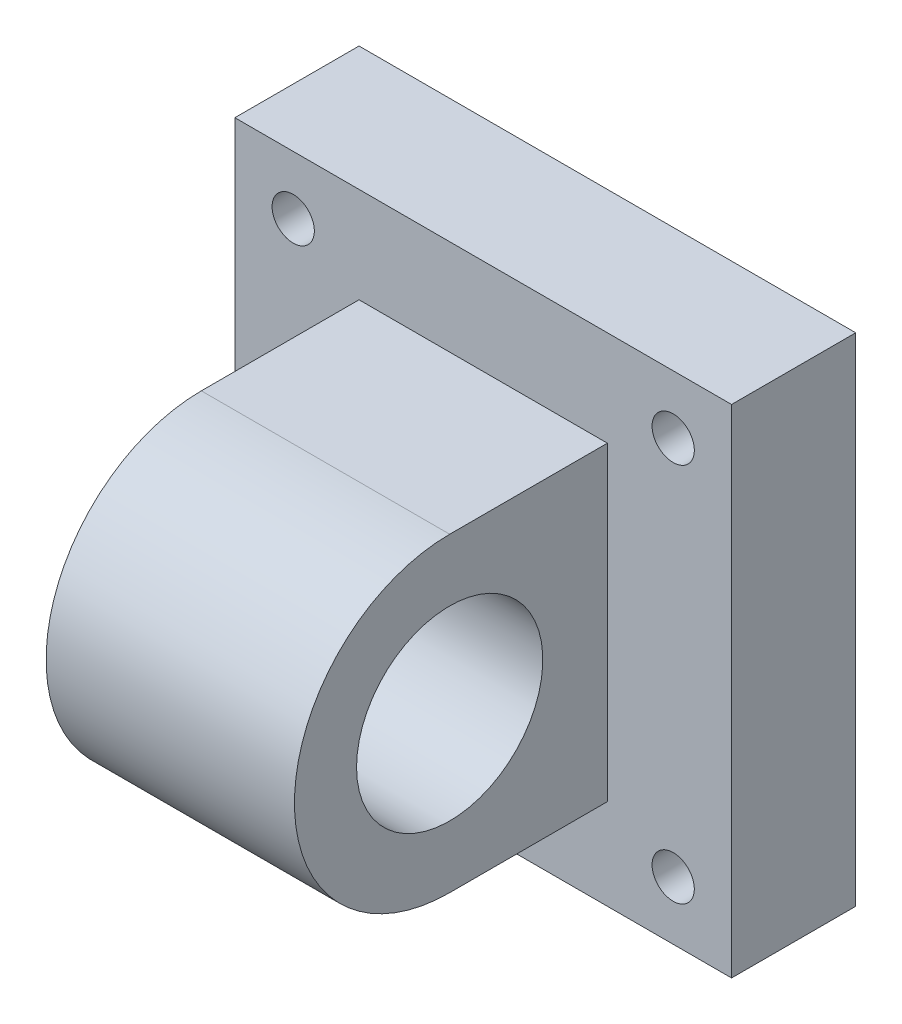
from build123d import *

# Parameters (mm, degrees)
SKETCH1_W                = 40
SKETCH1_H                = 40
BOSS_EXTRUDE1_DEPTH      = 10
BOSS_EXTRUDE2_DEPTH      = 10
BOSS_EXTRUDE2_DEPTH_BACK = 10
SKETCH10_R               = 7.5
SKETCH11_R               = 1.7
CUT_EXTRUDE1_DEPTH       = 20
MIRROR2_COPY_1_SKETCH_R  = 1.7
MIRROR2_COPY_1_DEPTH     = 20


with BuildPart() as part:
    # Sketch1 → Boss-Extrude1 (new body)
    with BuildSketch(Plane.XY):
        Rectangle(SKETCH1_W, SKETCH1_H)
    extrude(amount=BOSS_EXTRUDE1_DEPTH)

    # Sketch10 → Boss-Extrude2 (add, two sides: drawn at the far end of the back side and taken through both)
    with BuildSketch(Plane.ZY.offset(-BOSS_EXTRUDE2_DEPTH_BACK)):
        with BuildLine():
            Line((10, 12.3), (10, -12.7))
            Line((10, -12.7), (22.7, -12.7))
            ThreePointArc((22.7, -12.7), (35.2, -0.2), (22.7, 12.3))
            Line((22.7, 12.3), (10, 12.3))
        make_face()
        with Locations((22.7, -0.2)):
            Circle(SKETCH10_R, mode=Mode.SUBTRACT)
    extrude(amount=BOSS_EXTRUDE2_DEPTH + BOSS_EXTRUDE2_DEPTH_BACK)

    # Sketch11 → Cut-Extrude1 (cut)
    with BuildSketch(Plane(origin=(0, 0, 0), x_dir=(-1, 0, 0), z_dir=(0, 0, -1))):
        with Locations((15.3, 15.3)):
            Circle(SKETCH11_R)
    cut_extrude1 = extrude(amount=-CUT_EXTRUDE1_DEPTH, mode=Mode.SUBTRACT)

    # Mirror1: Cut-Extrude1 across plane
    add(cut_extrude1.mirror(Plane(origin=(0, 0, 0), x_dir=(0, 0, 1), z_dir=(0, -1, 0))), mode=Mode.SUBTRACT)

    # Mirror2: Cut-Extrude1 across plane
    add(cut_extrude1.mirror(Plane.ZY), mode=Mode.SUBTRACT)

    # Mirror2 copy 1 sketch → Mirror2 copy 1 (cut)
    with BuildSketch(Plane(origin=(0, 0, 0), x_dir=(1, 0, 0), z_dir=(0, 0, -1))):
        with Locations((15.3, 15.3)):
            Circle(MIRROR2_COPY_1_SKETCH_R)
    extrude(amount=-MIRROR2_COPY_1_DEPTH, mode=Mode.SUBTRACT)


solid = part.part
